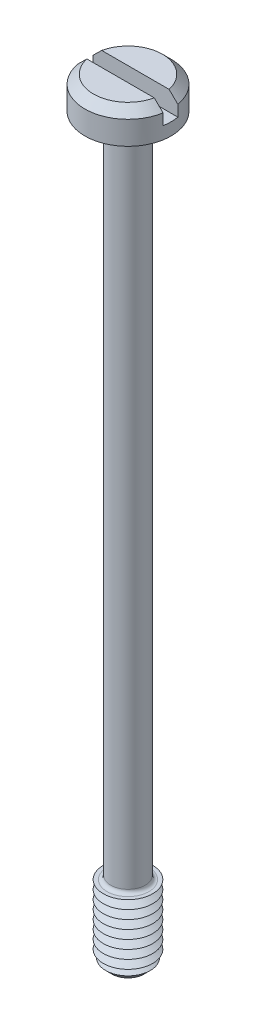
from build123d import *

# Parameters (mm, degrees)
SKETCH1_R           = 3.5
BOSS_EXTRUDE1_DEPTH = 2.6
SKETCH2_R           = 1.4
BOSS_EXTRUDE2_DEPTH = 60
SKETCH3_R           = 2
BOSS_EXTRUDE3_DEPTH = 6
CHAMFER1_SIZE       = 0.7
LPATTERN1_COUNT     = 8
LPATTERN1_PITCH     = 0.7
FILLET1_R           = 0.3
CHAMFER2_SIZE       = 0.7
SKETCH6_W           = 7
SKETCH6_H           = 1.2
CUT_EXTRUDE1_DEPTH  = 1.6


with BuildPart() as part:
    # Sketch1 → Boss-Extrude1 (new body)
    with BuildSketch(Plane(origin=(0, 0, 0), x_dir=(1, 0, 0), z_dir=(0, 1, 0))):
        with Locations(Location((0, 0, 0), (0, 0, 270))):
            Circle(SKETCH1_R)
    extrude(amount=BOSS_EXTRUDE1_DEPTH)

    # Sketch2 → Boss-Extrude2 (add)
    with BuildSketch(Plane.XZ):
        with Locations(Location((0, 0, 0), (0, 0, 270))):
            Circle(SKETCH2_R)
    extrude(amount=BOSS_EXTRUDE2_DEPTH)

    # Sketch3 → Boss-Extrude3 (add)
    with BuildSketch(Plane.XZ.offset(60)):
        with Locations(Location((0, 0, 0), (0, 0, 270))):
            Circle(SKETCH3_R)
    extrude(amount=-BOSS_EXTRUDE3_DEPTH)

    # Chamfer1
    chamfer1_edges = [part.edges().sort_by_distance(p)[0] for p in [
        (0, -60, 2),
    ]]
    chamfer(chamfer1_edges, length=CHAMFER1_SIZE)

    # Sketch5 → Cut-Revolve1 (revolve, cut)
    with BuildSketch(Plane(origin=(0, 0, 0), x_dir=(0, 0, -1), z_dir=(1, 0, 0))):
        Polygon((-2, -54), (-1.393782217, -54.35), (-2, -54.7), align=None)
    cut_revolve1 = revolve(axis=Axis((0, -6.58711856, 0), (0, -1, 0)), mode=Mode.SUBTRACT)

    # LPattern1: Cut-Revolve1 ×8
    with Locations(*[(0, -i * LPATTERN1_PITCH, 0) for i in range(1, LPATTERN1_COUNT)]):
        add(cut_revolve1, mode=Mode.SUBTRACT)

    # Fillet1
    fillet1_edges = [part.edges().sort_by_distance(p)[0] for p in [
        (0, 0, 1.4),
        (0, -54, 1.4),
    ]]
    fillet(fillet1_edges, radius=FILLET1_R)

    # Chamfer2
    chamfer2_edges = [part.edges().sort_by_distance(p)[0] for p in [
        (0, 2.6, -3.5),
    ]]
    chamfer(chamfer2_edges, length=CHAMFER2_SIZE)

    # Sketch6 → Cut-Extrude1 (cut)
    with BuildSketch(Plane(origin=(0, 2.6, 0), x_dir=(1, 0, 0), z_dir=(0, 1, 0))):
        Rectangle(SKETCH6_W, SKETCH6_H)
    extrude(amount=-CUT_EXTRUDE1_DEPTH, mode=Mode.SUBTRACT)


solid = part.part
